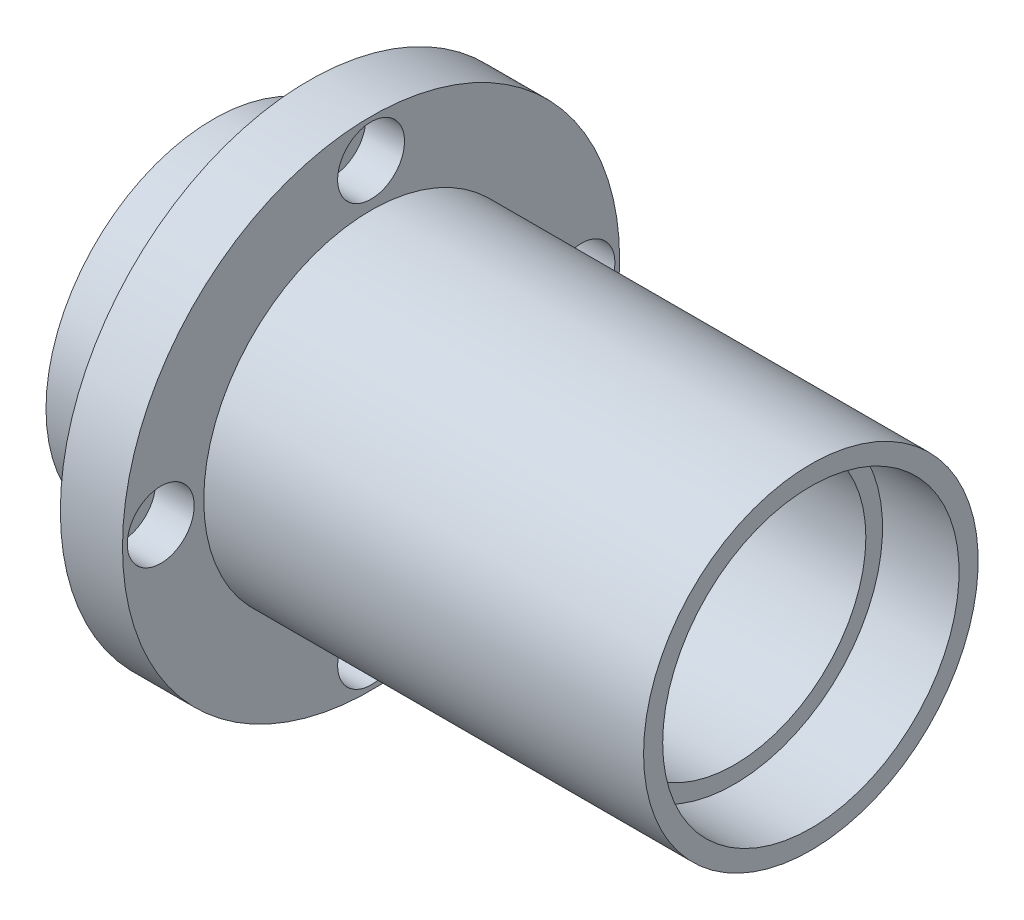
ISO-10303-21;
HEADER;
FILE_DESCRIPTION(('STEP AP214'),'2;1');
FILE_NAME('part.step','',(''),(''),'','','');
FILE_SCHEMA(('AUTOMOTIVE_DESIGN { 1 0 10303 214 1 1 1 1 }'));
ENDSEC;
DATA;
#1=APPLICATION_CONTEXT('core data for automotive mechanical design processes');
#2=APPLICATION_PROTOCOL_DEFINITION('international standard','automotive_design',2000,#1);
#3=PRODUCT_CONTEXT('',#1,'mechanical');
#4=PRODUCT('Part','Part','',(#3));
#5=PRODUCT_RELATED_PRODUCT_CATEGORY('part','',(#4));
#6=PRODUCT_DEFINITION_FORMATION('','',#4);
#7=PRODUCT_DEFINITION_CONTEXT('part definition',#1,'design');
#8=PRODUCT_DEFINITION('design','',#6,#7);
#9=PRODUCT_DEFINITION_SHAPE('','',#8);
#10=(LENGTH_UNIT() NAMED_UNIT(*) SI_UNIT(.MILLI.,.METRE.));
#11=(NAMED_UNIT(*) PLANE_ANGLE_UNIT() SI_UNIT($,.RADIAN.));
#12=(NAMED_UNIT(*) SI_UNIT($,.STERADIAN.) SOLID_ANGLE_UNIT());
#13=UNCERTAINTY_MEASURE_WITH_UNIT(LENGTH_MEASURE(1.E-05),#10,'distance_accuracy_value','');
#14=(GEOMETRIC_REPRESENTATION_CONTEXT(3) GLOBAL_UNCERTAINTY_ASSIGNED_CONTEXT((#13)) GLOBAL_UNIT_ASSIGNED_CONTEXT((#10,
#11,#12)) REPRESENTATION_CONTEXT('',''));
#15=CARTESIAN_POINT('',(0.,0.,0.));
#16=DIRECTION('',(0.,0.,1.));
#17=DIRECTION('',(1.,0.,0.));
#18=AXIS2_PLACEMENT_3D('',#15,#16,#17);
#19=CARTESIAN_POINT('',(33.,35.,0.));
#20=DIRECTION('',(-1.,0.,0.));
#21=DIRECTION('',(0.,0.,1.));
#22=AXIS2_PLACEMENT_3D('',#19,#20,#21);
#23=PLANE('',#22);
#24=CARTESIAN_POINT('',(33.,0.,44.));
#25=DIRECTION('',(-1.,0.,0.));
#26=DIRECTION('',(0.,0.,1.));
#27=AXIS2_PLACEMENT_3D('',#24,#25,#26);
#28=CIRCLE('',#27,7.);
#29=CARTESIAN_POINT('',(33.,0.,51.));
#30=VERTEX_POINT('',#29);
#31=EDGE_CURVE('E121',#30,#30,#28,.T.);
#32=ORIENTED_EDGE('',*,*,#31,.T.);
#33=EDGE_LOOP('',(#32));
#34=FACE_BOUND('',#33,.T.);
#35=CARTESIAN_POINT('',(33.,44.,0.));
#36=DIRECTION('',(-1.,0.,0.));
#37=DIRECTION('',(0.,0.,1.));
#38=AXIS2_PLACEMENT_3D('',#35,#36,#37);
#39=CIRCLE('',#38,7.);
#40=CARTESIAN_POINT('',(33.,44.,7.));
#41=VERTEX_POINT('',#40);
#42=EDGE_CURVE('E97',#41,#41,#39,.T.);
#43=ORIENTED_EDGE('',*,*,#42,.T.);
#44=EDGE_LOOP('',(#43));
#45=FACE_BOUND('',#44,.T.);
#46=CARTESIAN_POINT('',(33.,0.,0.));
#47=DIRECTION('',(-1.,0.,0.));
#48=DIRECTION('',(0.,0.,1.));
#49=AXIS2_PLACEMENT_3D('',#46,#47,#48);
#50=CIRCLE('',#49,52.);
#51=CARTESIAN_POINT('',(33.,0.,52.));
#52=VERTEX_POINT('',#51);
#53=EDGE_CURVE('E79',#52,#52,#50,.T.);
#54=ORIENTED_EDGE('',*,*,#53,.F.);
#55=EDGE_LOOP('',(#54));
#56=FACE_BOUND('',#55,.T.);
#57=CARTESIAN_POINT('',(33.,0.,0.));
#58=DIRECTION('',(-1.,0.,0.));
#59=DIRECTION('',(0.,0.,1.));
#60=AXIS2_PLACEMENT_3D('',#57,#58,#59);
#61=CIRCLE('',#60,35.);
#62=CARTESIAN_POINT('',(33.,0.,35.));
#63=VERTEX_POINT('',#62);
#64=EDGE_CURVE('E76',#63,#63,#61,.T.);
#65=ORIENTED_EDGE('',*,*,#64,.T.);
#66=EDGE_LOOP('',(#65));
#67=FACE_BOUND('',#66,.T.);
#68=CARTESIAN_POINT('',(33.,-44.,0.));
#69=DIRECTION('',(-1.,0.,0.));
#70=DIRECTION('',(0.,0.,1.));
#71=AXIS2_PLACEMENT_3D('',#68,#69,#70);
#72=CIRCLE('',#71,7.);
#73=CARTESIAN_POINT('',(33.,-44.,7.));
#74=VERTEX_POINT('',#73);
#75=EDGE_CURVE('E109',#74,#74,#72,.T.);
#76=ORIENTED_EDGE('',*,*,#75,.T.);
#77=EDGE_LOOP('',(#76));
#78=FACE_BOUND('',#77,.T.);
#79=CARTESIAN_POINT('',(33.,0.,-44.));
#80=DIRECTION('',(-1.,0.,0.));
#81=DIRECTION('',(0.,0.,1.));
#82=AXIS2_PLACEMENT_3D('',#79,#80,#81);
#83=CIRCLE('',#82,7.);
#84=CARTESIAN_POINT('',(33.,0.,-37.));
#85=VERTEX_POINT('',#84);
#86=EDGE_CURVE('E133',#85,#85,#83,.T.);
#87=ORIENTED_EDGE('',*,*,#86,.T.);
#88=EDGE_LOOP('',(#87));
#89=FACE_BOUND('',#88,.T.);
#90=ADVANCED_FACE('F44',(#34,#45,#56,#67,#78,#89),#23,.F.);
#91=CARTESIAN_POINT('',(20.,52.,0.));
#92=DIRECTION('',(1.,0.,0.));
#93=DIRECTION('',(0.,0.,-1.));
#94=AXIS2_PLACEMENT_3D('',#91,#92,#93);
#95=PLANE('',#94);
#96=CARTESIAN_POINT('',(20.,0.,44.));
#97=DIRECTION('',(-1.,0.,0.));
#98=DIRECTION('',(0.,0.,1.));
#99=AXIS2_PLACEMENT_3D('',#96,#97,#98);
#100=CIRCLE('',#99,4.5);
#101=CARTESIAN_POINT('',(20.,0.,48.5));
#102=VERTEX_POINT('',#101);
#103=EDGE_CURVE('E112',#102,#102,#100,.T.);
#104=ORIENTED_EDGE('',*,*,#103,.F.);
#105=EDGE_LOOP('',(#104));
#106=FACE_BOUND('',#105,.T.);
#107=CARTESIAN_POINT('',(20.,44.,0.));
#108=DIRECTION('',(-1.,0.,0.));
#109=DIRECTION('',(0.,0.,1.));
#110=AXIS2_PLACEMENT_3D('',#107,#108,#109);
#111=CIRCLE('',#110,4.5);
#112=CARTESIAN_POINT('',(20.,44.,4.5));
#113=VERTEX_POINT('',#112);
#114=EDGE_CURVE('E88',#113,#113,#111,.T.);
#115=ORIENTED_EDGE('',*,*,#114,.F.);
#116=EDGE_LOOP('',(#115));
#117=FACE_BOUND('',#116,.T.);
#118=CARTESIAN_POINT('',(20.,0.,0.));
#119=DIRECTION('',(-1.,0.,0.));
#120=DIRECTION('',(0.,0.,1.));
#121=AXIS2_PLACEMENT_3D('',#118,#119,#120);
#122=CIRCLE('',#121,35.);
#123=CARTESIAN_POINT('',(20.,0.,35.));
#124=VERTEX_POINT('',#123);
#125=EDGE_CURVE('E85',#124,#124,#122,.T.);
#126=ORIENTED_EDGE('',*,*,#125,.F.);
#127=EDGE_LOOP('',(#126));
#128=FACE_BOUND('',#127,.T.);
#129=CARTESIAN_POINT('',(20.,0.,0.));
#130=DIRECTION('',(-1.,0.,0.));
#131=DIRECTION('',(0.,0.,1.));
#132=AXIS2_PLACEMENT_3D('',#129,#130,#131);
#133=CIRCLE('',#132,52.);
#134=CARTESIAN_POINT('',(20.,0.,52.));
#135=VERTEX_POINT('',#134);
#136=EDGE_CURVE('E82',#135,#135,#133,.T.);
#137=ORIENTED_EDGE('',*,*,#136,.T.);
#138=EDGE_LOOP('',(#137));
#139=FACE_BOUND('',#138,.T.);
#140=CARTESIAN_POINT('',(20.,-44.,0.));
#141=DIRECTION('',(-1.,0.,0.));
#142=DIRECTION('',(0.,0.,1.));
#143=AXIS2_PLACEMENT_3D('',#140,#141,#142);
#144=CIRCLE('',#143,4.5);
#145=CARTESIAN_POINT('',(20.,-44.,4.5));
#146=VERTEX_POINT('',#145);
#147=EDGE_CURVE('E100',#146,#146,#144,.T.);
#148=ORIENTED_EDGE('',*,*,#147,.F.);
#149=EDGE_LOOP('',(#148));
#150=FACE_BOUND('',#149,.T.);
#151=CARTESIAN_POINT('',(20.,0.,-44.));
#152=DIRECTION('',(-1.,0.,0.));
#153=DIRECTION('',(0.,0.,1.));
#154=AXIS2_PLACEMENT_3D('',#151,#152,#153);
#155=CIRCLE('',#154,4.5);
#156=CARTESIAN_POINT('',(20.,0.,-39.5));
#157=VERTEX_POINT('',#156);
#158=EDGE_CURVE('E124',#157,#157,#155,.T.);
#159=ORIENTED_EDGE('',*,*,#158,.F.);
#160=EDGE_LOOP('',(#159));
#161=FACE_BOUND('',#160,.T.);
#162=ADVANCED_FACE('F150',(#106,#117,#128,#139,#150,#161),#95,.F.);
#163=CARTESIAN_POINT('',(125.,0.,0.));
#164=DIRECTION('',(-1.,0.,0.));
#165=DIRECTION('',(0.,0.,1.));
#166=AXIS2_PLACEMENT_3D('',#163,#164,#165);
#167=CYLINDRICAL_SURFACE('',#166,35.);
#168=CARTESIAN_POINT('',(0.,0.,0.));
#169=DIRECTION('',(-1.,0.,0.));
#170=DIRECTION('',(0.,0.,1.));
#171=AXIS2_PLACEMENT_3D('',#168,#169,#170);
#172=CIRCLE('',#171,35.);
#173=CARTESIAN_POINT('',(0.,0.,35.));
#174=VERTEX_POINT('',#173);
#175=EDGE_CURVE('E12',#174,#174,#172,.T.);
#176=ORIENTED_EDGE('',*,*,#175,.F.);
#177=EDGE_LOOP('',(#176));
#178=FACE_BOUND('',#177,.T.);
#179=ORIENTED_EDGE('',*,*,#125,.T.);
#180=EDGE_LOOP('',(#179));
#181=FACE_BOUND('',#180,.T.);
#182=ADVANCED_FACE('F46',(#178,#181),#167,.T.);
#183=CARTESIAN_POINT('',(0.,35.,0.));
#184=DIRECTION('',(1.,0.,0.));
#185=DIRECTION('',(0.,0.,-1.));
#186=AXIS2_PLACEMENT_3D('',#183,#184,#185);
#187=PLANE('',#186);
#188=CARTESIAN_POINT('',(0.,0.,0.));
#189=DIRECTION('',(-1.,0.,0.));
#190=DIRECTION('',(0.,0.,1.));
#191=AXIS2_PLACEMENT_3D('',#188,#189,#190);
#192=CIRCLE('',#191,31.);
#193=CARTESIAN_POINT('',(0.,0.,31.));
#194=VERTEX_POINT('',#193);
#195=EDGE_CURVE('E51',#194,#194,#192,.T.);
#196=ORIENTED_EDGE('',*,*,#195,.F.);
#197=EDGE_LOOP('',(#196));
#198=FACE_BOUND('',#197,.T.);
#199=ORIENTED_EDGE('',*,*,#175,.T.);
#200=EDGE_LOOP('',(#199));
#201=FACE_BOUND('',#200,.T.);
#202=ADVANCED_FACE('F188',(#198,#201),#187,.F.);
#203=CARTESIAN_POINT('',(125.,0.,0.));
#204=DIRECTION('',(-1.,0.,0.));
#205=DIRECTION('',(0.,0.,1.));
#206=AXIS2_PLACEMENT_3D('',#203,#204,#205);
#207=CYLINDRICAL_SURFACE('',#206,31.);
#208=CARTESIAN_POINT('',(16.,0.,0.));
#209=DIRECTION('',(-1.,0.,0.));
#210=DIRECTION('',(0.,0.,1.));
#211=AXIS2_PLACEMENT_3D('',#208,#209,#210);
#212=CIRCLE('',#211,31.);
#213=CARTESIAN_POINT('',(16.,0.,31.));
#214=VERTEX_POINT('',#213);
#215=EDGE_CURVE('E55',#214,#214,#212,.T.);
#216=ORIENTED_EDGE('',*,*,#215,.F.);
#217=EDGE_LOOP('',(#216));
#218=FACE_BOUND('',#217,.T.);
#219=ORIENTED_EDGE('',*,*,#195,.T.);
#220=EDGE_LOOP('',(#219));
#221=FACE_BOUND('',#220,.T.);
#222=ADVANCED_FACE('F185',(#218,#221),#207,.F.);
#223=CARTESIAN_POINT('',(16.,31.,0.));
#224=DIRECTION('',(1.,0.,0.));
#225=DIRECTION('',(0.,0.,-1.));
#226=AXIS2_PLACEMENT_3D('',#223,#224,#225);
#227=PLANE('',#226);
#228=CARTESIAN_POINT('',(16.,0.,0.));
#229=DIRECTION('',(-1.,0.,0.));
#230=DIRECTION('',(0.,0.,1.));
#231=AXIS2_PLACEMENT_3D('',#228,#229,#230);
#232=CIRCLE('',#231,27.5);
#233=CARTESIAN_POINT('',(16.,0.,27.5));
#234=VERTEX_POINT('',#233);
#235=EDGE_CURVE('E59',#234,#234,#232,.T.);
#236=ORIENTED_EDGE('',*,*,#235,.F.);
#237=EDGE_LOOP('',(#236));
#238=FACE_BOUND('',#237,.T.);
#239=ORIENTED_EDGE('',*,*,#215,.T.);
#240=EDGE_LOOP('',(#239));
#241=FACE_BOUND('',#240,.T.);
#242=ADVANCED_FACE('F181',(#238,#241),#227,.F.);
#243=CARTESIAN_POINT('',(125.,0.,0.));
#244=DIRECTION('',(-1.,0.,0.));
#245=DIRECTION('',(0.,0.,1.));
#246=AXIS2_PLACEMENT_3D('',#243,#244,#245);
#247=CYLINDRICAL_SURFACE('',#246,27.5);
#248=CARTESIAN_POINT('',(109.,0.,0.));
#249=DIRECTION('',(-1.,0.,0.));
#250=DIRECTION('',(0.,0.,1.));
#251=AXIS2_PLACEMENT_3D('',#248,#249,#250);
#252=CIRCLE('',#251,27.5);
#253=CARTESIAN_POINT('',(109.,0.,27.5));
#254=VERTEX_POINT('',#253);
#255=EDGE_CURVE('E64',#254,#254,#252,.T.);
#256=ORIENTED_EDGE('',*,*,#255,.F.);
#257=EDGE_LOOP('',(#256));
#258=FACE_BOUND('',#257,.T.);
#259=ORIENTED_EDGE('',*,*,#235,.T.);
#260=EDGE_LOOP('',(#259));
#261=FACE_BOUND('',#260,.T.);
#262=ADVANCED_FACE('F177',(#258,#261),#247,.F.);
#263=CARTESIAN_POINT('',(109.,27.5,0.));
#264=DIRECTION('',(-1.,0.,0.));
#265=DIRECTION('',(0.,0.,1.));
#266=AXIS2_PLACEMENT_3D('',#263,#264,#265);
#267=PLANE('',#266);
#268=CARTESIAN_POINT('',(109.,0.,0.));
#269=DIRECTION('',(-1.,0.,0.));
#270=DIRECTION('',(0.,0.,1.));
#271=AXIS2_PLACEMENT_3D('',#268,#269,#270);
#272=CIRCLE('',#271,31.);
#273=CARTESIAN_POINT('',(109.,0.,31.));
#274=VERTEX_POINT('',#273);
#275=EDGE_CURVE('E67',#274,#274,#272,.T.);
#276=ORIENTED_EDGE('',*,*,#275,.F.);
#277=EDGE_LOOP('',(#276));
#278=FACE_BOUND('',#277,.T.);
#279=ORIENTED_EDGE('',*,*,#255,.T.);
#280=EDGE_LOOP('',(#279));
#281=FACE_BOUND('',#280,.T.);
#282=ADVANCED_FACE('F173',(#278,#281),#267,.F.);
#283=CARTESIAN_POINT('',(125.,0.,0.));
#284=DIRECTION('',(-1.,0.,0.));
#285=DIRECTION('',(0.,0.,1.));
#286=AXIS2_PLACEMENT_3D('',#283,#284,#285);
#287=CYLINDRICAL_SURFACE('',#286,31.);
#288=CARTESIAN_POINT('',(125.,0.,0.));
#289=DIRECTION('',(-1.,0.,0.));
#290=DIRECTION('',(0.,0.,1.));
#291=AXIS2_PLACEMENT_3D('',#288,#289,#290);
#292=CIRCLE('',#291,31.);
#293=CARTESIAN_POINT('',(125.,0.,31.));
#294=VERTEX_POINT('',#293);
#295=EDGE_CURVE('E70',#294,#294,#292,.T.);
#296=ORIENTED_EDGE('',*,*,#295,.F.);
#297=EDGE_LOOP('',(#296));
#298=FACE_BOUND('',#297,.T.);
#299=ORIENTED_EDGE('',*,*,#275,.T.);
#300=EDGE_LOOP('',(#299));
#301=FACE_BOUND('',#300,.T.);
#302=ADVANCED_FACE('F169',(#298,#301),#287,.F.);
#303=CARTESIAN_POINT('',(125.,31.,0.));
#304=DIRECTION('',(-1.,0.,0.));
#305=DIRECTION('',(0.,0.,1.));
#306=AXIS2_PLACEMENT_3D('',#303,#304,#305);
#307=PLANE('',#306);
#308=CARTESIAN_POINT('',(125.,0.,0.));
#309=DIRECTION('',(-1.,0.,0.));
#310=DIRECTION('',(0.,0.,1.));
#311=AXIS2_PLACEMENT_3D('',#308,#309,#310);
#312=CIRCLE('',#311,35.);
#313=CARTESIAN_POINT('',(125.,0.,35.));
#314=VERTEX_POINT('',#313);
#315=EDGE_CURVE('E73',#314,#314,#312,.T.);
#316=ORIENTED_EDGE('',*,*,#315,.F.);
#317=EDGE_LOOP('',(#316));
#318=FACE_BOUND('',#317,.T.);
#319=ORIENTED_EDGE('',*,*,#295,.T.);
#320=EDGE_LOOP('',(#319));
#321=FACE_BOUND('',#320,.T.);
#322=ADVANCED_FACE('F165',(#318,#321),#307,.F.);
#323=CARTESIAN_POINT('',(125.,0.,0.));
#324=DIRECTION('',(-1.,0.,0.));
#325=DIRECTION('',(0.,0.,1.));
#326=AXIS2_PLACEMENT_3D('',#323,#324,#325);
#327=CYLINDRICAL_SURFACE('',#326,35.);
#328=ORIENTED_EDGE('',*,*,#64,.F.);
#329=EDGE_LOOP('',(#328));
#330=FACE_BOUND('',#329,.T.);
#331=ORIENTED_EDGE('',*,*,#315,.T.);
#332=EDGE_LOOP('',(#331));
#333=FACE_BOUND('',#332,.T.);
#334=ADVANCED_FACE('F162',(#330,#333),#327,.T.);
#335=CARTESIAN_POINT('',(125.,0.,0.));
#336=DIRECTION('',(-1.,0.,0.));
#337=DIRECTION('',(0.,0.,1.));
#338=AXIS2_PLACEMENT_3D('',#335,#336,#337);
#339=CYLINDRICAL_SURFACE('',#338,52.);
#340=ORIENTED_EDGE('',*,*,#136,.F.);
#341=EDGE_LOOP('',(#340));
#342=FACE_BOUND('',#341,.T.);
#343=ORIENTED_EDGE('',*,*,#53,.T.);
#344=EDGE_LOOP('',(#343));
#345=FACE_BOUND('',#344,.T.);
#346=ADVANCED_FACE('F161',(#342,#345),#339,.T.);
#347=CARTESIAN_POINT('',(33.,44.,0.));
#348=DIRECTION('',(-1.,0.,0.));
#349=DIRECTION('',(0.,0.,1.));
#350=AXIS2_PLACEMENT_3D('',#347,#348,#349);
#351=CYLINDRICAL_SURFACE('',#350,4.5);
#352=ORIENTED_EDGE('',*,*,#114,.T.);
#353=EDGE_LOOP('',(#352));
#354=FACE_BOUND('',#353,.T.);
#355=CARTESIAN_POINT('',(24.9,44.,0.));
#356=DIRECTION('',(-1.,0.,0.));
#357=DIRECTION('',(0.,0.,1.));
#358=AXIS2_PLACEMENT_3D('',#355,#356,#357);
#359=CIRCLE('',#358,4.5);
#360=CARTESIAN_POINT('',(24.9,44.,4.5));
#361=VERTEX_POINT('',#360);
#362=EDGE_CURVE('E91',#361,#361,#359,.T.);
#363=ORIENTED_EDGE('',*,*,#362,.F.);
#364=EDGE_LOOP('',(#363));
#365=FACE_BOUND('',#364,.T.);
#366=ADVANCED_FACE('F248',(#354,#365),#351,.F.);
#367=CARTESIAN_POINT('',(24.9,48.5,0.));
#368=DIRECTION('',(1.,0.,0.));
#369=DIRECTION('',(0.,0.,-1.));
#370=AXIS2_PLACEMENT_3D('',#367,#368,#369);
#371=PLANE('',#370);
#372=ORIENTED_EDGE('',*,*,#362,.T.);
#373=EDGE_LOOP('',(#372));
#374=FACE_BOUND('',#373,.T.);
#375=CARTESIAN_POINT('',(24.9,44.,0.));
#376=DIRECTION('',(-1.,0.,0.));
#377=DIRECTION('',(0.,0.,1.));
#378=AXIS2_PLACEMENT_3D('',#375,#376,#377);
#379=CIRCLE('',#378,7.);
#380=CARTESIAN_POINT('',(24.9,44.,7.));
#381=VERTEX_POINT('',#380);
#382=EDGE_CURVE('E94',#381,#381,#379,.T.);
#383=ORIENTED_EDGE('',*,*,#382,.F.);
#384=EDGE_LOOP('',(#383));
#385=FACE_BOUND('',#384,.T.);
#386=ADVANCED_FACE('F244',(#374,#385),#371,.T.);
#387=CARTESIAN_POINT('',(33.,44.,0.));
#388=DIRECTION('',(-1.,0.,0.));
#389=DIRECTION('',(0.,0.,1.));
#390=AXIS2_PLACEMENT_3D('',#387,#388,#389);
#391=CYLINDRICAL_SURFACE('',#390,7.);
#392=ORIENTED_EDGE('',*,*,#382,.T.);
#393=EDGE_LOOP('',(#392));
#394=FACE_BOUND('',#393,.T.);
#395=ORIENTED_EDGE('',*,*,#42,.F.);
#396=EDGE_LOOP('',(#395));
#397=FACE_BOUND('',#396,.T.);
#398=ADVANCED_FACE('F240',(#394,#397),#391,.F.);
#399=CARTESIAN_POINT('',(33.,-44.,0.));
#400=DIRECTION('',(-1.,0.,0.));
#401=DIRECTION('',(0.,0.,1.));
#402=AXIS2_PLACEMENT_3D('',#399,#400,#401);
#403=CYLINDRICAL_SURFACE('',#402,4.5);
#404=ORIENTED_EDGE('',*,*,#147,.T.);
#405=EDGE_LOOP('',(#404));
#406=FACE_BOUND('',#405,.T.);
#407=CARTESIAN_POINT('',(24.9,-44.,0.));
#408=DIRECTION('',(-1.,0.,0.));
#409=DIRECTION('',(0.,0.,1.));
#410=AXIS2_PLACEMENT_3D('',#407,#408,#409);
#411=CIRCLE('',#410,4.5);
#412=CARTESIAN_POINT('',(24.9,-44.,4.5));
#413=VERTEX_POINT('',#412);
#414=EDGE_CURVE('E103',#413,#413,#411,.T.);
#415=ORIENTED_EDGE('',*,*,#414,.F.);
#416=EDGE_LOOP('',(#415));
#417=FACE_BOUND('',#416,.T.);
#418=ADVANCED_FACE('F236',(#406,#417),#403,.F.);
#419=CARTESIAN_POINT('',(24.9,-39.5,0.));
#420=DIRECTION('',(1.,0.,0.));
#421=DIRECTION('',(0.,0.,-1.));
#422=AXIS2_PLACEMENT_3D('',#419,#420,#421);
#423=PLANE('',#422);
#424=ORIENTED_EDGE('',*,*,#414,.T.);
#425=EDGE_LOOP('',(#424));
#426=FACE_BOUND('',#425,.T.);
#427=CARTESIAN_POINT('',(24.9,-44.,0.));
#428=DIRECTION('',(-1.,0.,0.));
#429=DIRECTION('',(0.,0.,1.));
#430=AXIS2_PLACEMENT_3D('',#427,#428,#429);
#431=CIRCLE('',#430,7.);
#432=CARTESIAN_POINT('',(24.9,-44.,7.));
#433=VERTEX_POINT('',#432);
#434=EDGE_CURVE('E106',#433,#433,#431,.T.);
#435=ORIENTED_EDGE('',*,*,#434,.F.);
#436=EDGE_LOOP('',(#435));
#437=FACE_BOUND('',#436,.T.);
#438=ADVANCED_FACE('F232',(#426,#437),#423,.T.);
#439=CARTESIAN_POINT('',(33.,-44.,0.));
#440=DIRECTION('',(-1.,0.,0.));
#441=DIRECTION('',(0.,0.,1.));
#442=AXIS2_PLACEMENT_3D('',#439,#440,#441);
#443=CYLINDRICAL_SURFACE('',#442,7.);
#444=ORIENTED_EDGE('',*,*,#434,.T.);
#445=EDGE_LOOP('',(#444));
#446=FACE_BOUND('',#445,.T.);
#447=ORIENTED_EDGE('',*,*,#75,.F.);
#448=EDGE_LOOP('',(#447));
#449=FACE_BOUND('',#448,.T.);
#450=ADVANCED_FACE('F228',(#446,#449),#443,.F.);
#451=CARTESIAN_POINT('',(33.,0.,44.));
#452=DIRECTION('',(-1.,0.,0.));
#453=DIRECTION('',(0.,0.,1.));
#454=AXIS2_PLACEMENT_3D('',#451,#452,#453);
#455=CYLINDRICAL_SURFACE('',#454,4.5);
#456=ORIENTED_EDGE('',*,*,#103,.T.);
#457=EDGE_LOOP('',(#456));
#458=FACE_BOUND('',#457,.T.);
#459=CARTESIAN_POINT('',(24.9,0.,44.));
#460=DIRECTION('',(-1.,0.,0.));
#461=DIRECTION('',(0.,0.,1.));
#462=AXIS2_PLACEMENT_3D('',#459,#460,#461);
#463=CIRCLE('',#462,4.5);
#464=CARTESIAN_POINT('',(24.9,0.,48.5));
#465=VERTEX_POINT('',#464);
#466=EDGE_CURVE('E115',#465,#465,#463,.T.);
#467=ORIENTED_EDGE('',*,*,#466,.F.);
#468=EDGE_LOOP('',(#467));
#469=FACE_BOUND('',#468,.T.);
#470=ADVANCED_FACE('F224',(#458,#469),#455,.F.);
#471=CARTESIAN_POINT('',(24.9,4.5,44.));
#472=DIRECTION('',(1.,0.,0.));
#473=DIRECTION('',(0.,0.,-1.));
#474=AXIS2_PLACEMENT_3D('',#471,#472,#473);
#475=PLANE('',#474);
#476=ORIENTED_EDGE('',*,*,#466,.T.);
#477=EDGE_LOOP('',(#476));
#478=FACE_BOUND('',#477,.T.);
#479=CARTESIAN_POINT('',(24.9,0.,44.));
#480=DIRECTION('',(-1.,0.,0.));
#481=DIRECTION('',(0.,0.,1.));
#482=AXIS2_PLACEMENT_3D('',#479,#480,#481);
#483=CIRCLE('',#482,7.);
#484=CARTESIAN_POINT('',(24.9,0.,51.));
#485=VERTEX_POINT('',#484);
#486=EDGE_CURVE('E118',#485,#485,#483,.T.);
#487=ORIENTED_EDGE('',*,*,#486,.F.);
#488=EDGE_LOOP('',(#487));
#489=FACE_BOUND('',#488,.T.);
#490=ADVANCED_FACE('F218',(#478,#489),#475,.T.);
#491=CARTESIAN_POINT('',(33.,0.,44.));
#492=DIRECTION('',(-1.,0.,0.));
#493=DIRECTION('',(0.,0.,1.));
#494=AXIS2_PLACEMENT_3D('',#491,#492,#493);
#495=CYLINDRICAL_SURFACE('',#494,7.);
#496=ORIENTED_EDGE('',*,*,#486,.T.);
#497=EDGE_LOOP('',(#496));
#498=FACE_BOUND('',#497,.T.);
#499=ORIENTED_EDGE('',*,*,#31,.F.);
#500=EDGE_LOOP('',(#499));
#501=FACE_BOUND('',#500,.T.);
#502=ADVANCED_FACE('F210',(#498,#501),#495,.F.);
#503=CARTESIAN_POINT('',(33.,0.,-44.));
#504=DIRECTION('',(-1.,0.,0.));
#505=DIRECTION('',(0.,0.,1.));
#506=AXIS2_PLACEMENT_3D('',#503,#504,#505);
#507=CYLINDRICAL_SURFACE('',#506,4.5);
#508=ORIENTED_EDGE('',*,*,#158,.T.);
#509=EDGE_LOOP('',(#508));
#510=FACE_BOUND('',#509,.T.);
#511=CARTESIAN_POINT('',(24.9,0.,-44.));
#512=DIRECTION('',(-1.,0.,0.));
#513=DIRECTION('',(0.,0.,1.));
#514=AXIS2_PLACEMENT_3D('',#511,#512,#513);
#515=CIRCLE('',#514,4.5);
#516=CARTESIAN_POINT('',(24.9,0.,-39.5));
#517=VERTEX_POINT('',#516);
#518=EDGE_CURVE('E127',#517,#517,#515,.T.);
#519=ORIENTED_EDGE('',*,*,#518,.F.);
#520=EDGE_LOOP('',(#519));
#521=FACE_BOUND('',#520,.T.);
#522=ADVANCED_FACE('F146',(#510,#521),#507,.F.);
#523=CARTESIAN_POINT('',(24.9,4.5,-44.));
#524=DIRECTION('',(1.,0.,0.));
#525=DIRECTION('',(0.,0.,-1.));
#526=AXIS2_PLACEMENT_3D('',#523,#524,#525);
#527=PLANE('',#526);
#528=ORIENTED_EDGE('',*,*,#518,.T.);
#529=EDGE_LOOP('',(#528));
#530=FACE_BOUND('',#529,.T.);
#531=CARTESIAN_POINT('',(24.9,0.,-44.));
#532=DIRECTION('',(-1.,0.,0.));
#533=DIRECTION('',(0.,0.,1.));
#534=AXIS2_PLACEMENT_3D('',#531,#532,#533);
#535=CIRCLE('',#534,7.);
#536=CARTESIAN_POINT('',(24.9,0.,-37.));
#537=VERTEX_POINT('',#536);
#538=EDGE_CURVE('E130',#537,#537,#535,.T.);
#539=ORIENTED_EDGE('',*,*,#538,.F.);
#540=EDGE_LOOP('',(#539));
#541=FACE_BOUND('',#540,.T.);
#542=ADVANCED_FACE('F140',(#530,#541),#527,.T.);
#543=CARTESIAN_POINT('',(33.,0.,-44.));
#544=DIRECTION('',(-1.,0.,0.));
#545=DIRECTION('',(0.,0.,1.));
#546=AXIS2_PLACEMENT_3D('',#543,#544,#545);
#547=CYLINDRICAL_SURFACE('',#546,7.);
#548=ORIENTED_EDGE('',*,*,#538,.T.);
#549=EDGE_LOOP('',(#548));
#550=FACE_BOUND('',#549,.T.);
#551=ORIENTED_EDGE('',*,*,#86,.F.);
#552=EDGE_LOOP('',(#551));
#553=FACE_BOUND('',#552,.T.);
#554=ADVANCED_FACE('F138',(#550,#553),#547,.F.);
#555=CLOSED_SHELL('',(#90,#162,#182,#202,#222,#242,#262,#282,#302,#322,#334,#346,#366,#386,#398,
#418,#438,#450,#470,#490,#502,#522,#542,#554));
#556=MANIFOLD_SOLID_BREP('B2',#555);
#557=ADVANCED_BREP_SHAPE_REPRESENTATION('',(#18,#556),#14);
#558=SHAPE_DEFINITION_REPRESENTATION(#9,#557);
ENDSEC;
END-ISO-10303-21;
